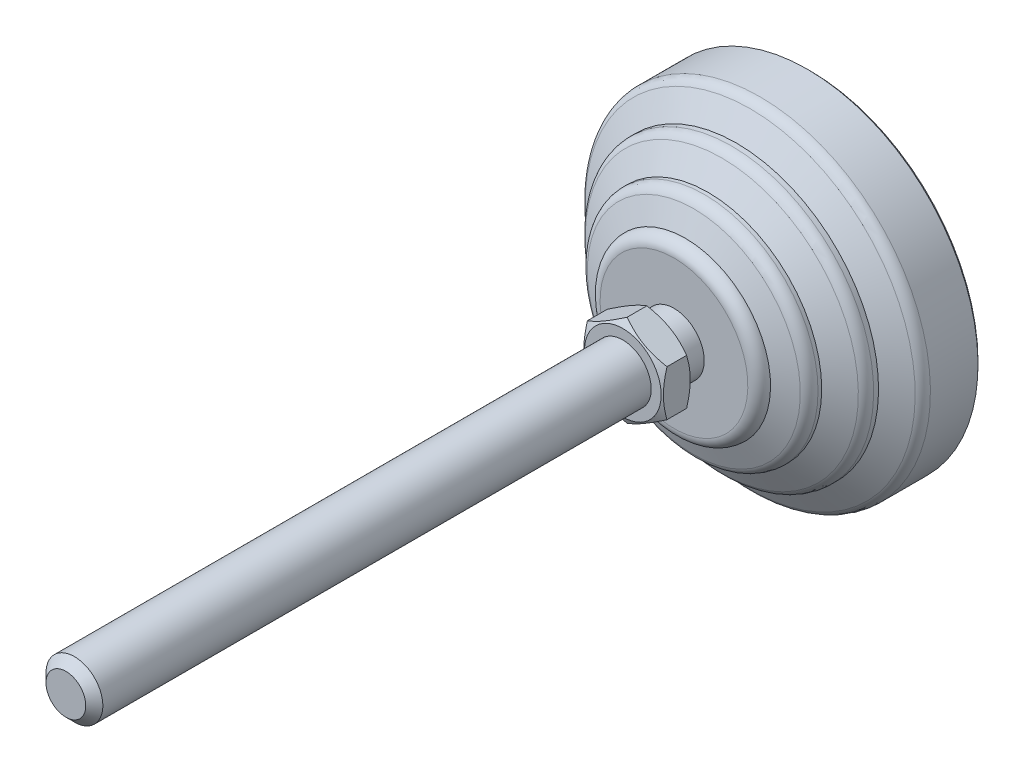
ISO-10303-21;
HEADER;
FILE_DESCRIPTION(('STEP AP214'),'2;1');
FILE_NAME('part.step','',(''),(''),'','','');
FILE_SCHEMA(('AUTOMOTIVE_DESIGN { 1 0 10303 214 1 1 1 1 }'));
ENDSEC;
DATA;
#1=APPLICATION_CONTEXT('core data for automotive mechanical design processes');
#2=APPLICATION_PROTOCOL_DEFINITION('international standard','automotive_design',2000,#1);
#3=PRODUCT_CONTEXT('',#1,'mechanical');
#4=PRODUCT('Part','Part','',(#3));
#5=PRODUCT_RELATED_PRODUCT_CATEGORY('part','',(#4));
#6=PRODUCT_DEFINITION_FORMATION('','',#4);
#7=PRODUCT_DEFINITION_CONTEXT('part definition',#1,'design');
#8=PRODUCT_DEFINITION('design','',#6,#7);
#9=PRODUCT_DEFINITION_SHAPE('','',#8);
#10=(LENGTH_UNIT() NAMED_UNIT(*) SI_UNIT(.MILLI.,.METRE.));
#11=(NAMED_UNIT(*) PLANE_ANGLE_UNIT() SI_UNIT($,.RADIAN.));
#12=(NAMED_UNIT(*) SI_UNIT($,.STERADIAN.) SOLID_ANGLE_UNIT());
#13=UNCERTAINTY_MEASURE_WITH_UNIT(LENGTH_MEASURE(1.E-05),#10,'distance_accuracy_value','');
#14=(GEOMETRIC_REPRESENTATION_CONTEXT(3) GLOBAL_UNCERTAINTY_ASSIGNED_CONTEXT((#13)) GLOBAL_UNIT_ASSIGNED_CONTEXT((#10,
#11,#12)) REPRESENTATION_CONTEXT('',''));
#15=CARTESIAN_POINT('',(0.,0.,0.));
#16=DIRECTION('',(0.,0.,1.));
#17=DIRECTION('',(1.,0.,0.));
#18=AXIS2_PLACEMENT_3D('',#15,#16,#17);
#19=CARTESIAN_POINT('',(-29.5,0.,0.));
#20=DIRECTION('',(0.,0.,1.));
#21=DIRECTION('',(0.,-1.,0.));
#22=AXIS2_PLACEMENT_3D('',#19,#20,#21);
#23=PLANE('',#22);
#24=CARTESIAN_POINT('',(0.,0.,0.));
#25=DIRECTION('',(0.,0.,-1.));
#26=DIRECTION('',(0.,1.,0.));
#27=AXIS2_PLACEMENT_3D('',#24,#25,#26);
#28=CIRCLE('',#27,29.5);
#29=CARTESIAN_POINT('',(0.,29.5,0.));
#30=VERTEX_POINT('',#29);
#31=EDGE_CURVE('E95',#30,#30,#28,.T.);
#32=ORIENTED_EDGE('',*,*,#31,.T.);
#33=EDGE_LOOP('',(#32));
#34=FACE_BOUND('',#33,.T.);
#35=ADVANCED_FACE('F14',(#34),#23,.F.);
#36=CARTESIAN_POINT('',(-5.32445501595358,0.,28.));
#37=DIRECTION('',(0.,0.,1.));
#38=DIRECTION('',(0.,-1.,0.));
#39=AXIS2_PLACEMENT_3D('',#36,#37,#38);
#40=PLANE('',#39);
#41=CARTESIAN_POINT('',(0.,0.,28.));
#42=DIRECTION('',(0.,0.,1.));
#43=DIRECTION('',(1.,0.,0.));
#44=AXIS2_PLACEMENT_3D('',#41,#42,#43);
#45=CIRCLE('',#44,6.75);
#46=CARTESIAN_POINT('',(6.75,0.,28.));
#47=VERTEX_POINT('',#46);
#48=EDGE_CURVE('E542',#47,#47,#45,.T.);
#49=ORIENTED_EDGE('',*,*,#48,.F.);
#50=EDGE_LOOP('',(#49));
#51=FACE_BOUND('',#50,.T.);
#52=CARTESIAN_POINT('',(0.,0.,28.));
#53=DIRECTION('',(0.,0.,-1.));
#54=DIRECTION('',(0.,1.,0.));
#55=AXIS2_PLACEMENT_3D('',#52,#53,#54);
#56=CIRCLE('',#55,5.32445501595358);
#57=CARTESIAN_POINT('',(0.,5.32445501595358,28.));
#58=VERTEX_POINT('',#57);
#59=EDGE_CURVE('E74',#58,#58,#56,.T.);
#60=ORIENTED_EDGE('',*,*,#59,.F.);
#61=EDGE_LOOP('',(#60));
#62=FACE_BOUND('',#61,.T.);
#63=ADVANCED_FACE('F270',(#51,#62),#40,.F.);
#64=CARTESIAN_POINT('',(0.,0.,0.));
#65=DIRECTION('',(0.,0.,-1.));
#66=DIRECTION('',(0.,1.,0.));
#67=AXIS2_PLACEMENT_3D('',#64,#65,#66);
#68=CYLINDRICAL_SURFACE('',#67,5.32445501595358);
#69=CARTESIAN_POINT('',(0.,0.,24.));
#70=DIRECTION('',(0.,0.,-1.));
#71=DIRECTION('',(0.,1.,0.));
#72=AXIS2_PLACEMENT_3D('',#69,#70,#71);
#73=CIRCLE('',#72,5.32445501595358);
#74=CARTESIAN_POINT('',(0.,5.32445501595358,24.));
#75=VERTEX_POINT('',#74);
#76=EDGE_CURVE('E131',#75,#75,#73,.T.);
#77=ORIENTED_EDGE('',*,*,#76,.F.);
#78=EDGE_LOOP('',(#77));
#79=FACE_BOUND('',#78,.T.);
#80=ORIENTED_EDGE('',*,*,#59,.T.);
#81=EDGE_LOOP('',(#80));
#82=FACE_BOUND('',#81,.T.);
#83=ADVANCED_FACE('F266',(#79,#82),#68,.T.);
#84=CARTESIAN_POINT('',(-13.,0.,24.));
#85=DIRECTION('',(0.,0.,-1.));
#86=DIRECTION('',(0.,1.,0.));
#87=AXIS2_PLACEMENT_3D('',#84,#85,#86);
#88=PLANE('',#87);
#89=CARTESIAN_POINT('',(0.,0.,24.));
#90=DIRECTION('',(0.,0.,-1.));
#91=DIRECTION('',(0.,1.,0.));
#92=AXIS2_PLACEMENT_3D('',#89,#90,#91);
#93=CIRCLE('',#92,13.);
#94=CARTESIAN_POINT('',(0.,13.,24.));
#95=VERTEX_POINT('',#94);
#96=EDGE_CURVE('E128',#95,#95,#93,.T.);
#97=ORIENTED_EDGE('',*,*,#96,.F.);
#98=EDGE_LOOP('',(#97));
#99=FACE_BOUND('',#98,.T.);
#100=ORIENTED_EDGE('',*,*,#76,.T.);
#101=EDGE_LOOP('',(#100));
#102=FACE_BOUND('',#101,.T.);
#103=ADVANCED_FACE('F262',(#99,#102),#88,.F.);
#104=CARTESIAN_POINT('',(0.,0.,22.));
#105=DIRECTION('',(0.,0.,-1.));
#106=DIRECTION('',(0.,1.,0.));
#107=AXIS2_PLACEMENT_3D('',#104,#105,#106);
#108=TOROIDAL_SURFACE('',#107,13.,2.);
#109=CARTESIAN_POINT('',(0.,0.,22.));
#110=DIRECTION('',(0.,0.,-1.));
#111=DIRECTION('',(0.,1.,0.));
#112=AXIS2_PLACEMENT_3D('',#109,#110,#111);
#113=CIRCLE('',#112,15.);
#114=CARTESIAN_POINT('',(0.,15.,22.));
#115=VERTEX_POINT('',#114);
#116=EDGE_CURVE('E125',#115,#115,#113,.T.);
#117=ORIENTED_EDGE('',*,*,#116,.F.);
#118=EDGE_LOOP('',(#117));
#119=FACE_BOUND('',#118,.T.);
#120=ORIENTED_EDGE('',*,*,#96,.T.);
#121=EDGE_LOOP('',(#120));
#122=FACE_BOUND('',#121,.T.);
#123=ADVANCED_FACE('F258',(#119,#122),#108,.T.);
#124=CARTESIAN_POINT('',(0.,0.,22.));
#125=DIRECTION('',(0.,0.,-1.));
#126=DIRECTION('',(0.,1.,0.));
#127=AXIS2_PLACEMENT_3D('',#124,#125,#126);
#128=CONICAL_SURFACE('',#127,15.,1.19028994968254);
#129=CARTESIAN_POINT('',(0.,0.,20.5028874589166));
#130=DIRECTION('',(0.,0.,-1.));
#131=DIRECTION('',(0.,1.,0.));
#132=AXIS2_PLACEMENT_3D('',#129,#130,#131);
#133=CIRCLE('',#132,18.7427813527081);
#134=CARTESIAN_POINT('',(0.,18.7427813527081,20.5028874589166));
#135=VERTEX_POINT('',#134);
#136=EDGE_CURVE('E122',#135,#135,#133,.T.);
#137=ORIENTED_EDGE('',*,*,#136,.F.);
#138=EDGE_LOOP('',(#137));
#139=FACE_BOUND('',#138,.T.);
#140=ORIENTED_EDGE('',*,*,#116,.T.);
#141=EDGE_LOOP('',(#140));
#142=FACE_BOUND('',#141,.T.);
#143=ADVANCED_FACE('F254',(#139,#142),#128,.T.);
#144=CARTESIAN_POINT('',(0.,0.,18.6459340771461));
#145=DIRECTION('',(0.,0.,-1.));
#146=DIRECTION('',(0.,1.,0.));
#147=AXIS2_PLACEMENT_3D('',#144,#145,#146);
#148=TOROIDAL_SURFACE('',#147,18.,2.00000000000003);
#149=CARTESIAN_POINT('',(0.,0.,18.645934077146));
#150=DIRECTION('',(0.,0.,-1.));
#151=DIRECTION('',(0.,1.,0.));
#152=AXIS2_PLACEMENT_3D('',#149,#150,#151);
#153=CIRCLE('',#152,20.);
#154=CARTESIAN_POINT('',(0.,20.,18.645934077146));
#155=VERTEX_POINT('',#154);
#156=EDGE_CURVE('E119',#155,#155,#153,.T.);
#157=ORIENTED_EDGE('',*,*,#156,.F.);
#158=EDGE_LOOP('',(#157));
#159=FACE_BOUND('',#158,.T.);
#160=ORIENTED_EDGE('',*,*,#136,.T.);
#161=EDGE_LOOP('',(#160));
#162=FACE_BOUND('',#161,.T.);
#163=ADVANCED_FACE('F250',(#159,#162),#148,.T.);
#164=CARTESIAN_POINT('',(0.,0.,0.));
#165=DIRECTION('',(0.,0.,-1.));
#166=DIRECTION('',(0.,1.,0.));
#167=AXIS2_PLACEMENT_3D('',#164,#165,#166);
#168=CYLINDRICAL_SURFACE('',#167,20.);
#169=CARTESIAN_POINT('',(0.,0.,18.));
#170=DIRECTION('',(0.,0.,-1.));
#171=DIRECTION('',(0.,1.,0.));
#172=AXIS2_PLACEMENT_3D('',#169,#170,#171);
#173=CIRCLE('',#172,20.);
#174=CARTESIAN_POINT('',(0.,20.,18.));
#175=VERTEX_POINT('',#174);
#176=EDGE_CURVE('E116',#175,#175,#173,.T.);
#177=ORIENTED_EDGE('',*,*,#176,.F.);
#178=EDGE_LOOP('',(#177));
#179=FACE_BOUND('',#178,.T.);
#180=ORIENTED_EDGE('',*,*,#156,.T.);
#181=EDGE_LOOP('',(#180));
#182=FACE_BOUND('',#181,.T.);
#183=ADVANCED_FACE('F246',(#179,#182),#168,.T.);
#184=CARTESIAN_POINT('',(0.,0.,18.));
#185=DIRECTION('',(0.,0.,-1.));
#186=DIRECTION('',(0.,1.,0.));
#187=AXIS2_PLACEMENT_3D('',#184,#185,#186);
#188=CONICAL_SURFACE('',#187,20.,1.03037682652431);
#189=CARTESIAN_POINT('',(0.,0.,15.5826050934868));
#190=DIRECTION('',(0.,0.,-1.));
#191=DIRECTION('',(0.,1.,0.));
#192=AXIS2_PLACEMENT_3D('',#189,#190,#191);
#193=CIRCLE('',#192,24.0289915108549);
#194=CARTESIAN_POINT('',(0.,24.0289915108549,15.5826050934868));
#195=VERTEX_POINT('',#194);
#196=EDGE_CURVE('E113',#195,#195,#193,.T.);
#197=ORIENTED_EDGE('',*,*,#196,.F.);
#198=EDGE_LOOP('',(#197));
#199=FACE_BOUND('',#198,.T.);
#200=ORIENTED_EDGE('',*,*,#176,.T.);
#201=EDGE_LOOP('',(#200));
#202=FACE_BOUND('',#201,.T.);
#203=ADVANCED_FACE('F242',(#199,#202),#188,.T.);
#204=CARTESIAN_POINT('',(0.,0.,13.8676192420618));
#205=DIRECTION('',(0.,0.,-1.));
#206=DIRECTION('',(0.,1.,0.));
#207=AXIS2_PLACEMENT_3D('',#204,#205,#206);
#208=TOROIDAL_SURFACE('',#207,23.,2.00000000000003);
#209=CARTESIAN_POINT('',(0.,0.,13.8676192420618));
#210=DIRECTION('',(0.,0.,-1.));
#211=DIRECTION('',(0.,1.,0.));
#212=AXIS2_PLACEMENT_3D('',#209,#210,#211);
#213=CIRCLE('',#212,25.);
#214=CARTESIAN_POINT('',(0.,25.,13.8676192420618));
#215=VERTEX_POINT('',#214);
#216=EDGE_CURVE('E110',#215,#215,#213,.T.);
#217=ORIENTED_EDGE('',*,*,#216,.F.);
#218=EDGE_LOOP('',(#217));
#219=FACE_BOUND('',#218,.T.);
#220=ORIENTED_EDGE('',*,*,#196,.T.);
#221=EDGE_LOOP('',(#220));
#222=FACE_BOUND('',#221,.T.);
#223=ADVANCED_FACE('F238',(#219,#222),#208,.T.);
#224=CARTESIAN_POINT('',(0.,0.,0.));
#225=DIRECTION('',(0.,0.,-1.));
#226=DIRECTION('',(0.,1.,0.));
#227=AXIS2_PLACEMENT_3D('',#224,#225,#226);
#228=CYLINDRICAL_SURFACE('',#227,25.);
#229=CARTESIAN_POINT('',(0.,0.,13.));
#230=DIRECTION('',(0.,0.,-1.));
#231=DIRECTION('',(0.,1.,0.));
#232=AXIS2_PLACEMENT_3D('',#229,#230,#231);
#233=CIRCLE('',#232,25.);
#234=CARTESIAN_POINT('',(0.,25.,13.));
#235=VERTEX_POINT('',#234);
#236=EDGE_CURVE('E107',#235,#235,#233,.T.);
#237=ORIENTED_EDGE('',*,*,#236,.F.);
#238=EDGE_LOOP('',(#237));
#239=FACE_BOUND('',#238,.T.);
#240=ORIENTED_EDGE('',*,*,#216,.T.);
#241=EDGE_LOOP('',(#240));
#242=FACE_BOUND('',#241,.T.);
#243=ADVANCED_FACE('F234',(#239,#242),#228,.T.);
#244=CARTESIAN_POINT('',(0.,0.,13.));
#245=DIRECTION('',(0.,0.,-1.));
#246=DIRECTION('',(0.,1.,0.));
#247=AXIS2_PLACEMENT_3D('',#244,#245,#246);
#248=CONICAL_SURFACE('',#247,25.,1.03037682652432);
#249=CARTESIAN_POINT('',(0.,0.,10.5826050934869));
#250=DIRECTION('',(0.,0.,-1.));
#251=DIRECTION('',(0.,1.,0.));
#252=AXIS2_PLACEMENT_3D('',#249,#250,#251);
#253=CIRCLE('',#252,29.028991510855);
#254=CARTESIAN_POINT('',(0.,29.028991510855,10.5826050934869));
#255=VERTEX_POINT('',#254);
#256=EDGE_CURVE('E104',#255,#255,#253,.T.);
#257=ORIENTED_EDGE('',*,*,#256,.F.);
#258=EDGE_LOOP('',(#257));
#259=FACE_BOUND('',#258,.T.);
#260=ORIENTED_EDGE('',*,*,#236,.T.);
#261=EDGE_LOOP('',(#260));
#262=FACE_BOUND('',#261,.T.);
#263=ADVANCED_FACE('F230',(#259,#262),#248,.T.);
#264=CARTESIAN_POINT('',(0.,0.,8.86761924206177));
#265=DIRECTION('',(0.,0.,-1.));
#266=DIRECTION('',(0.,1.,0.));
#267=AXIS2_PLACEMENT_3D('',#264,#265,#266);
#268=TOROIDAL_SURFACE('',#267,28.,2.00000000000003);
#269=CARTESIAN_POINT('',(0.,0.,8.86761924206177));
#270=DIRECTION('',(0.,0.,-1.));
#271=DIRECTION('',(0.,1.,0.));
#272=AXIS2_PLACEMENT_3D('',#269,#270,#271);
#273=CIRCLE('',#272,30.);
#274=CARTESIAN_POINT('',(0.,30.,8.86761924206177));
#275=VERTEX_POINT('',#274);
#276=EDGE_CURVE('E101',#275,#275,#273,.T.);
#277=ORIENTED_EDGE('',*,*,#276,.F.);
#278=EDGE_LOOP('',(#277));
#279=FACE_BOUND('',#278,.T.);
#280=ORIENTED_EDGE('',*,*,#256,.T.);
#281=EDGE_LOOP('',(#280));
#282=FACE_BOUND('',#281,.T.);
#283=ADVANCED_FACE('F226',(#279,#282),#268,.T.);
#284=CARTESIAN_POINT('',(0.,0.,0.));
#285=DIRECTION('',(0.,0.,-1.));
#286=DIRECTION('',(0.,1.,0.));
#287=AXIS2_PLACEMENT_3D('',#284,#285,#286);
#288=CYLINDRICAL_SURFACE('',#287,30.);
#289=CARTESIAN_POINT('',(0.,0.,0.499999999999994));
#290=DIRECTION('',(0.,0.,-1.));
#291=DIRECTION('',(0.,1.,0.));
#292=AXIS2_PLACEMENT_3D('',#289,#290,#291);
#293=CIRCLE('',#292,30.);
#294=CARTESIAN_POINT('',(0.,30.,0.499999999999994));
#295=VERTEX_POINT('',#294);
#296=EDGE_CURVE('E98',#295,#295,#293,.T.);
#297=ORIENTED_EDGE('',*,*,#296,.F.);
#298=EDGE_LOOP('',(#297));
#299=FACE_BOUND('',#298,.T.);
#300=ORIENTED_EDGE('',*,*,#276,.T.);
#301=EDGE_LOOP('',(#300));
#302=FACE_BOUND('',#301,.T.);
#303=ADVANCED_FACE('F222',(#299,#302),#288,.T.);
#304=CARTESIAN_POINT('',(0.,0.,0.499999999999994));
#305=DIRECTION('',(0.,0.,1.));
#306=DIRECTION('',(0.,-1.,0.));
#307=AXIS2_PLACEMENT_3D('',#304,#305,#306);
#308=CONICAL_SURFACE('',#307,30.,0.785398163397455);
#309=ORIENTED_EDGE('',*,*,#31,.F.);
#310=EDGE_LOOP('',(#309));
#311=FACE_BOUND('',#310,.T.);
#312=ORIENTED_EDGE('',*,*,#296,.T.);
#313=EDGE_LOOP('',(#312));
#314=FACE_BOUND('',#313,.T.);
#315=ADVANCED_FACE('F150',(#311,#314),#308,.T.);
#316=CARTESIAN_POINT('',(0.,0.,28.));
#317=DIRECTION('',(0.,0.,1.));
#318=DIRECTION('',(1.,0.,0.));
#319=AXIS2_PLACEMENT_3D('',#316,#317,#318);
#320=CONICAL_SURFACE('',#319,6.75,1.0471975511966);
#321=CARTESIAN_POINT('',(0.000200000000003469,-8.0830192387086,28.7696190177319));
#322=CARTESIAN_POINT('',(-0.153667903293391,-7.99418356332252,28.7183374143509));
#323=CARTESIAN_POINT('',(-0.30810950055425,-7.90501666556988,28.669383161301));
#324=CARTESIAN_POINT('',(-0.618246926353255,-7.72595873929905,28.5767703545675));
#325=CARTESIAN_POINT('',(-0.773943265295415,-7.63606741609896,28.5331140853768));
#326=CARTESIAN_POINT('',(-1.24352516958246,-7.36495417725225,28.4109491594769));
#327=CARTESIAN_POINT('',(-1.5592643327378,-7.18266208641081,28.3414631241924));
#328=CARTESIAN_POINT('',(-2.03176224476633,-6.90986528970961,28.2599825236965));
#329=CARTESIAN_POINT('',(-2.18710922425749,-6.82017566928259,28.2367710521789));
#330=CARTESIAN_POINT('',(-2.49850511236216,-6.64039116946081,28.1978487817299));
#331=CARTESIAN_POINT('',(-2.65455395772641,-6.55029632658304,28.1821373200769));
#332=CARTESIAN_POINT('',(-2.96692267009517,-6.36995016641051,28.1586154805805));
#333=CARTESIAN_POINT('',(-3.12324202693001,-6.27969914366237,28.1507961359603));
#334=CARTESIAN_POINT('',(-3.43601650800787,-6.09911871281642,28.1432178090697));
#335=CARTESIAN_POINT('',(-3.59247162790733,-6.00878930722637,28.1434585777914));
#336=CARTESIAN_POINT('',(-4.02110687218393,-5.76131663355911,28.155197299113));
#337=CARTESIAN_POINT('',(-4.2931466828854,-5.60425437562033,28.1749033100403));
#338=CARTESIAN_POINT('',(-4.83541944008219,-5.29117305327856,28.2373910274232));
#339=CARTESIAN_POINT('',(-5.10565047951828,-5.13515508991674,28.2801940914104));
#340=CARTESIAN_POINT('',(-5.64901454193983,-4.82144370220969,28.3871892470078));
#341=CARTESIAN_POINT('',(-5.92207900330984,-4.6637898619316,28.4518346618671));
#342=CARTESIAN_POINT('',(-6.46413578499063,-4.35083323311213,28.5985536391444));
#343=CARTESIAN_POINT('',(-6.73313504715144,-4.19552643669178,28.680592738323));
#344=CARTESIAN_POINT('',(-7.0002,-4.04133641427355,28.7696190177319));
#345=B_SPLINE_CURVE_WITH_KNOTS('',3,(#321,#322,#323,#324,#325,#326,#327,#328,#329,#330,#331,
#332,#333,#334,#335,#336,#337,#338,#339,#340,#341,#342,#343,#344),.UNSPECIFIED.,.F.,.F.,(4,2,2,
2,2,2,2,2,2,2,2,4),(0.,0.554727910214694,1.10969417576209,2.2219327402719,2.76443041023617,
3.30688013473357,3.8487128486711,4.39052882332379,5.33376515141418,6.27787517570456,
7.24292418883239,8.20607866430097),.UNSPECIFIED.);
#346=CARTESIAN_POINT('',(0.,-8.08290376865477,28.7695523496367));
#347=VERTEX_POINT('',#346);
#348=CARTESIAN_POINT('',(-7.,-4.04145188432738,28.7695523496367));
#349=VERTEX_POINT('',#348);
#350=EDGE_CURVE('E69',#347,#349,#345,.T.);
#351=ORIENTED_EDGE('',*,*,#350,.T.);
#352=CARTESIAN_POINT('',(-7.,-10.8452199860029,31.5553751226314));
#353=CARTESIAN_POINT('',(-7.,-10.5395720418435,31.4071511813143));
#354=CARTESIAN_POINT('',(-7.,-10.2332213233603,31.2603515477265));
#355=CARTESIAN_POINT('',(-7.,-9.61874054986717,30.9704021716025));
#356=CARTESIAN_POINT('',(-7.,-9.31061022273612,30.8272530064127));
#357=CARTESIAN_POINT('',(-7.,-8.69060378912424,30.544683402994));
#358=CARTESIAN_POINT('',(-7.,-8.378716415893,30.4052876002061));
#359=CARTESIAN_POINT('',(-7.,-7.75245735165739,30.1322147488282));
#360=CARTESIAN_POINT('',(-7.,-7.43808577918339,29.998537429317));
#361=CARTESIAN_POINT('',(-7.,-6.79625322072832,29.7342508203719));
#362=CARTESIAN_POINT('',(-7.,-6.46869506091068,29.6038762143));
#363=CARTESIAN_POINT('',(-7.,-5.8097434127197,29.3530199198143));
#364=CARTESIAN_POINT('',(-7.,-5.47834949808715,29.2325393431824));
#365=CARTESIAN_POINT('',(-7.,-4.81181879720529,29.0046420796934));
#366=CARTESIAN_POINT('',(-7.,-4.47669118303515,28.8971988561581));
#367=CARTESIAN_POINT('',(-7.,-3.80164083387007,28.6988295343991));
#368=CARTESIAN_POINT('',(-7.,-3.46171964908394,28.6078982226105));
#369=CARTESIAN_POINT('',(-7.,-2.77871657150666,28.4474124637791));
#370=CARTESIAN_POINT('',(-7.,-2.43566256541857,28.377742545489));
#371=CARTESIAN_POINT('',(-7.,-1.91796608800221,28.2922053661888));
#372=CARTESIAN_POINT('',(-7.,-1.74486856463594,28.2668530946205));
#373=CARTESIAN_POINT('',(-7.,-1.39781674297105,28.2229686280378));
#374=CARTESIAN_POINT('',(-7.,-1.22386252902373,28.2044357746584));
#375=CARTESIAN_POINT('',(-7.,-0.877598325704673,28.1747912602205));
#376=CARTESIAN_POINT('',(-7.,-0.705296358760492,28.1635862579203));
#377=CARTESIAN_POINT('',(-7.,-0.360373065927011,28.1484717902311));
#378=CARTESIAN_POINT('',(-7.,-0.187751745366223,28.1445622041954));
#379=CARTESIAN_POINT('',(-7.,0.157501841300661,28.144131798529));
#380=CARTESIAN_POINT('',(-7.,0.330134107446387,28.1476110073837));
#381=CARTESIAN_POINT('',(-7.,0.675098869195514,28.1618733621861));
#382=CARTESIAN_POINT('',(-7.,0.847431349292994,28.1726568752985));
#383=CARTESIAN_POINT('',(-7.,1.26191843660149,28.2071493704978));
#384=CARTESIAN_POINT('',(-7.,1.50378924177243,28.2343417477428));
#385=CARTESIAN_POINT('',(-7.,1.98571736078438,28.3016288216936));
#386=CARTESIAN_POINT('',(-7.,2.2257744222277,28.3417252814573));
#387=CARTESIAN_POINT('',(-7.,2.94296071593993,28.4792430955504));
#388=CARTESIAN_POINT('',(-7.,3.41683397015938,28.5938673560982));
#389=CARTESIAN_POINT('',(-7.,4.12538961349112,28.7924093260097));
#390=CARTESIAN_POINT('',(-7.,4.36375290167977,28.8639442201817));
#391=CARTESIAN_POINT('',(-7.,4.83816391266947,29.0143875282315));
#392=CARTESIAN_POINT('',(-7.,5.07421162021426,29.0932959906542));
#393=CARTESIAN_POINT('',(-7.,5.54406683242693,29.2572250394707));
#394=CARTESIAN_POINT('',(-7.,5.77787505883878,29.34224357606));
#395=CARTESIAN_POINT('',(-7.,6.24355808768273,29.5173980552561));
#396=CARTESIAN_POINT('',(-7.,6.47543291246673,29.6075339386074));
#397=CARTESIAN_POINT('',(-7.,7.02148459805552,29.8256304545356));
#398=CARTESIAN_POINT('',(-7.,7.33492707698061,29.9554263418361));
#399=CARTESIAN_POINT('',(-7.,7.95915802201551,30.2212686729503));
#400=CARTESIAN_POINT('',(-7.,8.26994632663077,30.3573154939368));
#401=CARTESIAN_POINT('',(-7.,8.8893557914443,30.6344071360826));
#402=CARTESIAN_POINT('',(-7.,9.19797650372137,30.7754529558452));
#403=CARTESIAN_POINT('',(-7.,9.81336169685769,31.0615445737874));
#404=CARTESIAN_POINT('',(-7.,10.1201261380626,31.2065904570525));
#405=CARTESIAN_POINT('',(-7.,10.7324212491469,31.5000858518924));
#406=CARTESIAN_POINT('',(-7.,11.0379502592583,31.6485388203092));
#407=CARTESIAN_POINT('',(-7.,11.6476939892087,31.9481222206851));
#408=CARTESIAN_POINT('',(-7.,11.9519086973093,32.0992526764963));
#409=CARTESIAN_POINT('',(-7.,12.8628143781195,32.555909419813));
#410=CARTESIAN_POINT('',(-7.,13.4678484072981,32.8647404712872));
#411=CARTESIAN_POINT('',(-7.,14.6242379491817,33.4625166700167));
#412=CARTESIAN_POINT('',(-7.,15.1758513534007,33.7509651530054));
#413=CARTESIAN_POINT('',(-7.,16.2770286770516,34.3317917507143));
#414=CARTESIAN_POINT('',(-7.,16.8265925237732,34.6241700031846));
#415=CARTESIAN_POINT('',(-7.,17.9227595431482,35.211191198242));
#416=CARTESIAN_POINT('',(-7.,18.4693666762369,35.5058267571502));
#417=CARTESIAN_POINT('',(-7.,19.5612700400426,36.0974468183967));
#418=CARTESIAN_POINT('',(-7.,20.1065663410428,36.3944311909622));
#419=CARTESIAN_POINT('',(-7.,20.6513799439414,36.6922925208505));
#420=B_SPLINE_CURVE_WITH_KNOTS('',3,(#352,#353,#354,#355,#356,#357,#358,#359,#360,#361,#362,
#363,#364,#365,#366,#367,#368,#369,#370,#371,#372,#373,#374,#375,#376,#377,#378,#379,#380,#381,
#382,#383,#384,#385,#386,#387,#388,#389,#390,#391,#392,#393,#394,#395,#396,#397,#398,#399,#400,
#401,#402,#403,#404,#405,#406,#407,#408,#409,#410,#411,#412,#413,#414,#415,#416,#417,#418,#419),
.UNSPECIFIED.,.F.,.F.,(4,2,2,2,2,2,2,2,2,2,2,2,2,2,2,2,2,2,2,2,2,2,2,2,2,2,2,2,2,2,2,2,2,4),(0.,
1.0190900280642,2.03834024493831,3.0631573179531,4.08792578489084,5.14545340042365,
6.20309968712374,7.2585557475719,8.31367797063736,9.36296340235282,9.88768295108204,
10.4123518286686,10.930200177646,11.4480399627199,11.9658817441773,12.4837495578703,
13.213520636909,13.9433914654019,15.4039463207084,16.1504827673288,16.8970241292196,
17.643316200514,18.3895996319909,19.4072697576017,20.4250013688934,21.4429374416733,
22.4608951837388,23.4799358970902,24.4989856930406,26.5368137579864,28.4042333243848,
30.2717185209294,32.1345879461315,33.9973551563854),.UNSPECIFIED.);
#421=CARTESIAN_POINT('',(-7.,4.04145188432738,28.7695523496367));
#422=VERTEX_POINT('',#421);
#423=EDGE_CURVE('E80',#349,#422,#420,.T.);
#424=ORIENTED_EDGE('',*,*,#423,.T.);
#425=CARTESIAN_POINT('',(-7.0002,4.04133641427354,28.7696190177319));
#426=CARTESIAN_POINT('',(-6.84633209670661,4.13017208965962,28.7183374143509));
#427=CARTESIAN_POINT('',(-6.69189049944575,4.21933898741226,28.669383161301));
#428=CARTESIAN_POINT('',(-6.38175307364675,4.39839691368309,28.5767703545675));
#429=CARTESIAN_POINT('',(-6.22605673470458,4.48828823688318,28.5331140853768));
#430=CARTESIAN_POINT('',(-5.75647483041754,4.75940147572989,28.4109491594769));
#431=CARTESIAN_POINT('',(-5.4407356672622,4.94169356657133,28.3414631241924));
#432=CARTESIAN_POINT('',(-4.96823775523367,5.21449036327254,28.2599825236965));
#433=CARTESIAN_POINT('',(-4.81289077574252,5.30417998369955,28.2367710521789));
#434=CARTESIAN_POINT('',(-4.50149488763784,5.48396448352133,28.1978487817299));
#435=CARTESIAN_POINT('',(-4.34544604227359,5.57405932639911,28.1821373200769));
#436=CARTESIAN_POINT('',(-4.03307732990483,5.75440548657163,28.1586154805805));
#437=CARTESIAN_POINT('',(-3.87675797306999,5.84465650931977,28.1507961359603));
#438=CARTESIAN_POINT('',(-3.56398349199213,6.02523694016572,28.1432178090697));
#439=CARTESIAN_POINT('',(-3.40752837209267,6.11556634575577,28.1434585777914));
#440=CARTESIAN_POINT('',(-2.97889312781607,6.36303901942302,28.155197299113));
#441=CARTESIAN_POINT('',(-2.7068533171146,6.52010127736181,28.1749033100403));
#442=CARTESIAN_POINT('',(-2.16458055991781,6.83318259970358,28.2373910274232));
#443=CARTESIAN_POINT('',(-1.89434952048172,6.9892005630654,28.2801940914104));
#444=CARTESIAN_POINT('',(-1.35098545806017,7.30291195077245,28.3871892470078));
#445=CARTESIAN_POINT('',(-1.07792099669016,7.46056579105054,28.4518346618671));
#446=CARTESIAN_POINT('',(-0.535864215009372,7.77352241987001,28.5985536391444));
#447=CARTESIAN_POINT('',(-0.266864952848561,7.92882921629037,28.680592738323));
#448=CARTESIAN_POINT('',(0.000199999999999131,8.0830192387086,28.7696190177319));
#449=B_SPLINE_CURVE_WITH_KNOTS('',3,(#425,#426,#427,#428,#429,#430,#431,#432,#433,#434,#435,
#436,#437,#438,#439,#440,#441,#442,#443,#444,#445,#446,#447,#448),.UNSPECIFIED.,.F.,.F.,(4,2,2,
2,2,2,2,2,2,2,2,4),(0.,0.554727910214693,1.10969417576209,2.2219327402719,2.76443041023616,
3.30688013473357,3.84871284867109,4.39052882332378,5.33376515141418,6.27787517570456,
7.2429241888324,8.20607866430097),.UNSPECIFIED.);
#450=CARTESIAN_POINT('',(0.,8.08290376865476,28.7695523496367));
#451=VERTEX_POINT('',#450);
#452=EDGE_CURVE('E174',#422,#451,#449,.T.);
#453=ORIENTED_EDGE('',*,*,#452,.T.);
#454=CARTESIAN_POINT('',(-0.000200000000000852,8.0830192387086,28.7696190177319));
#455=CARTESIAN_POINT('',(0.15366790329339,7.99418356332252,28.7183374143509));
#456=CARTESIAN_POINT('',(0.308109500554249,7.90501666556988,28.669383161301));
#457=CARTESIAN_POINT('',(0.618246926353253,7.72595873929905,28.5767703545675));
#458=CARTESIAN_POINT('',(0.773943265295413,7.63606741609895,28.5331140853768));
#459=CARTESIAN_POINT('',(1.24352516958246,7.36495417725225,28.4109491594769));
#460=CARTESIAN_POINT('',(1.5592643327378,7.18266208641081,28.3414631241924));
#461=CARTESIAN_POINT('',(2.03176224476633,6.9098652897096,28.2599825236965));
#462=CARTESIAN_POINT('',(2.18710922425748,6.82017566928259,28.2367710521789));
#463=CARTESIAN_POINT('',(2.49850511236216,6.64039116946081,28.1978487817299));
#464=CARTESIAN_POINT('',(2.65455395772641,6.55029632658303,28.1821373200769));
#465=CARTESIAN_POINT('',(2.96692267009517,6.36995016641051,28.1586154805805));
#466=CARTESIAN_POINT('',(3.12324202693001,6.27969914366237,28.1507961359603));
#467=CARTESIAN_POINT('',(3.43601650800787,6.09911871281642,28.1432178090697));
#468=CARTESIAN_POINT('',(3.59247162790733,6.00878930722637,28.1434585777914));
#469=CARTESIAN_POINT('',(4.02110687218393,5.76131663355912,28.155197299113));
#470=CARTESIAN_POINT('',(4.2931466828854,5.60425437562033,28.1749033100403));
#471=CARTESIAN_POINT('',(4.83541944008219,5.29117305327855,28.2373910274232));
#472=CARTESIAN_POINT('',(5.10565047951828,5.13515508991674,28.2801940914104));
#473=CARTESIAN_POINT('',(5.64901454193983,4.82144370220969,28.3871892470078));
#474=CARTESIAN_POINT('',(5.92207900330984,4.66378986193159,28.4518346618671));
#475=CARTESIAN_POINT('',(6.46413578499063,4.35083323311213,28.5985536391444));
#476=CARTESIAN_POINT('',(6.73313504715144,4.19552643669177,28.680592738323));
#477=CARTESIAN_POINT('',(7.0002,4.04133641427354,28.7696190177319));
#478=B_SPLINE_CURVE_WITH_KNOTS('',3,(#454,#455,#456,#457,#458,#459,#460,#461,#462,#463,#464,
#465,#466,#467,#468,#469,#470,#471,#472,#473,#474,#475,#476,#477),.UNSPECIFIED.,.F.,.F.,(4,2,2,
2,2,2,2,2,2,2,2,4),(0.,0.554727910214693,1.10969417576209,2.2219327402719,2.76443041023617,
3.30688013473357,3.8487128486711,4.39052882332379,5.33376515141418,6.27787517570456,
7.2429241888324,8.20607866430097),.UNSPECIFIED.);
#479=CARTESIAN_POINT('',(7.,4.04145188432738,28.7695523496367));
#480=VERTEX_POINT('',#479);
#481=EDGE_CURVE('E167',#451,#480,#478,.T.);
#482=ORIENTED_EDGE('',*,*,#481,.T.);
#483=CARTESIAN_POINT('',(7.,-10.8452199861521,31.5553751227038));
#484=CARTESIAN_POINT('',(7.,-10.5395720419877,31.4071511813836));
#485=CARTESIAN_POINT('',(7.,-10.2332213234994,31.2603515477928));
#486=CARTESIAN_POINT('',(7.,-9.61874054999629,30.9704021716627));
#487=CARTESIAN_POINT('',(7.,-9.31061022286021,30.82725300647));
#488=CARTESIAN_POINT('',(7.,-8.69060378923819,30.5446834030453));
#489=CARTESIAN_POINT('',(7.,-8.37871641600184,30.4052876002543));
#490=CARTESIAN_POINT('',(7.,-7.75245735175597,30.1322147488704));
#491=CARTESIAN_POINT('',(7.,-7.43808577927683,29.9985374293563));
#492=CARTESIAN_POINT('',(7.,-6.79625322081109,29.7342508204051));
#493=CARTESIAN_POINT('',(7.,-6.46869506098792,29.6038762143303));
#494=CARTESIAN_POINT('',(7.,-5.8097434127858,29.3530199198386));
#495=CARTESIAN_POINT('',(7.,-5.47834949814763,29.2325393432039));
#496=CARTESIAN_POINT('',(7.,-4.81181879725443,29.0046420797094));
#497=CARTESIAN_POINT('',(7.,-4.47669118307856,28.8971988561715));
#498=CARTESIAN_POINT('',(7.,-3.80164083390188,28.6988295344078));
#499=CARTESIAN_POINT('',(7.,-3.46171964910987,28.607898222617));
#500=CARTESIAN_POINT('',(7.,-2.77871657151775,28.4474124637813));
#501=CARTESIAN_POINT('',(7.,-2.43566256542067,28.3777425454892));
#502=CARTESIAN_POINT('',(7.,-1.91796608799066,28.292205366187));
#503=CARTESIAN_POINT('',(7.,-1.74486856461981,28.2668530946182));
#504=CARTESIAN_POINT('',(7.,-1.39781674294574,28.2229686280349));
#505=CARTESIAN_POINT('',(7.,-1.2238625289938,28.2044357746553));
#506=CARTESIAN_POINT('',(7.,-0.877598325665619,28.1747912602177));
#507=CARTESIAN_POINT('',(7.,-0.705296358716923,28.1635862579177));
#508=CARTESIAN_POINT('',(7.,-0.360373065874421,28.1484717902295));
#509=CARTESIAN_POINT('',(7.,-0.187751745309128,28.1445622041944));
#510=CARTESIAN_POINT('',(7.,0.15750184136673,28.1441317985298));
#511=CARTESIAN_POINT('',(7.,0.330134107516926,28.1476110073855));
#512=CARTESIAN_POINT('',(7.,0.675098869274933,28.1618733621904));
#513=CARTESIAN_POINT('',(7.,0.847431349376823,28.1726568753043));
#514=CARTESIAN_POINT('',(7.,1.26191843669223,28.2071493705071));
#515=CARTESIAN_POINT('',(7.,1.50378924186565,28.234341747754));
#516=CARTESIAN_POINT('',(7.,1.98571736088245,28.301628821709));
#517=CARTESIAN_POINT('',(7.,2.22577442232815,28.3417252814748));
#518=CARTESIAN_POINT('',(7.,2.94296071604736,28.4792430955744));
#519=CARTESIAN_POINT('',(7.,3.41683397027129,28.5938673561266));
#520=CARTESIAN_POINT('',(7.,4.12538961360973,28.7924093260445));
#521=CARTESIAN_POINT('',(7.,4.36375290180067,28.8639442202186));
#522=CARTESIAN_POINT('',(7.,4.83816391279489,29.0143875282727));
#523=CARTESIAN_POINT('',(7.,5.07421162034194,29.0932959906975));
#524=CARTESIAN_POINT('',(7.,5.5440668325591,29.2572250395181));
#525=CARTESIAN_POINT('',(7.,5.77787505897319,29.3422435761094));
#526=CARTESIAN_POINT('',(7.,6.24355808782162,29.5173980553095));
#527=CARTESIAN_POINT('',(7.,6.47543291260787,29.6075339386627));
#528=CARTESIAN_POINT('',(7.,7.02148459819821,29.825630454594));
#529=CARTESIAN_POINT('',(7.,7.33492707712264,29.9554263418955));
#530=CARTESIAN_POINT('',(7.,7.95915802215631,30.2212686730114));
#531=CARTESIAN_POINT('',(7.,8.269946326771,30.3573154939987));
#532=CARTESIAN_POINT('',(7.,8.88935579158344,30.6344071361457));
#533=CARTESIAN_POINT('',(7.,9.19797650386,30.7754529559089));
#534=CARTESIAN_POINT('',(7.,9.81336169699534,31.0615445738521));
#535=CARTESIAN_POINT('',(7.,10.1201261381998,31.2065904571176));
#536=CARTESIAN_POINT('',(7.,10.7324212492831,31.5000858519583));
#537=CARTESIAN_POINT('',(7.,11.0379502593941,31.6485388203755));
#538=CARTESIAN_POINT('',(7.,11.6476939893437,31.9481222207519));
#539=CARTESIAN_POINT('',(7.,11.9519086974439,32.0992526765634));
#540=CARTESIAN_POINT('',(7.,12.862814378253,32.5559094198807));
#541=CARTESIAN_POINT('',(7.,13.4678484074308,32.8647404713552));
#542=CARTESIAN_POINT('',(7.,14.6242379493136,33.4625166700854));
#543=CARTESIAN_POINT('',(7.,15.1758513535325,33.7509651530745));
#544=CARTESIAN_POINT('',(7.,16.2770286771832,34.3317917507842));
#545=CARTESIAN_POINT('',(7.,16.8265925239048,34.6241700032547));
#546=CARTESIAN_POINT('',(7.,17.9227595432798,35.2111911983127));
#547=CARTESIAN_POINT('',(7.,18.4693666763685,35.5058267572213));
#548=CARTESIAN_POINT('',(7.,19.5612700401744,36.0974468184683));
#549=CARTESIAN_POINT('',(7.,20.1065663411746,36.3944311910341));
#550=CARTESIAN_POINT('',(7.,20.6513799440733,36.6922925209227));
#551=B_SPLINE_CURVE_WITH_KNOTS('',3,(#483,#484,#485,#486,#487,#488,#489,#490,#491,#492,#493,
#494,#495,#496,#497,#498,#499,#500,#501,#502,#503,#504,#505,#506,#507,#508,#509,#510,#511,#512,
#513,#514,#515,#516,#517,#518,#519,#520,#521,#522,#523,#524,#525,#526,#527,#528,#529,#530,#531,
#532,#533,#534,#535,#536,#537,#538,#539,#540,#541,#542,#543,#544,#545,#546,#547,#548,#549,#550),
.UNSPECIFIED.,.F.,.F.,(4,2,2,2,2,2,2,2,2,2,2,2,2,2,2,2,2,2,2,2,2,2,2,2,2,2,2,2,2,2,2,2,2,4),(0.,
1.01909002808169,2.0383402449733,3.06315731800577,4.0879257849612,5.14545340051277,
6.20309968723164,7.25855574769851,8.31367797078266,9.36296340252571,9.88768295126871,
10.4123518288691,10.9302001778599,11.4480399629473,11.9658817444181,12.4837495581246,
13.2135206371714,13.9433914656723,15.403946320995,16.1504827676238,16.8970241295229,
17.6433162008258,18.389599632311,19.4072697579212,20.4250013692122,21.4429374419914,
22.4608951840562,23.4799358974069,24.4989856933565,26.5368137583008,28.4042333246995,
30.2717185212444,32.134587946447,33.9973551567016),.UNSPECIFIED.);
#552=CARTESIAN_POINT('',(7.,-4.04145188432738,28.7695523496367));
#553=VERTEX_POINT('',#552);
#554=EDGE_CURVE('E29',#480,#553,#551,.F.);
#555=ORIENTED_EDGE('',*,*,#554,.T.);
#556=CARTESIAN_POINT('',(7.0002,-4.04133641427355,28.7696190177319));
#557=CARTESIAN_POINT('',(6.84633209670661,-4.13017208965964,28.7183374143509));
#558=CARTESIAN_POINT('',(6.69189049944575,-4.21933898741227,28.669383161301));
#559=CARTESIAN_POINT('',(6.38175307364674,-4.3983969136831,28.5767703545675));
#560=CARTESIAN_POINT('',(6.22605673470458,-4.4882882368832,28.5331140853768));
#561=CARTESIAN_POINT('',(5.75647483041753,-4.7594014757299,28.4109491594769));
#562=CARTESIAN_POINT('',(5.4407356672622,-4.94169356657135,28.3414631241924));
#563=CARTESIAN_POINT('',(4.96823775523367,-5.21449036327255,28.2599825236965));
#564=CARTESIAN_POINT('',(4.81289077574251,-5.30417998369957,28.2367710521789));
#565=CARTESIAN_POINT('',(4.50149488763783,-5.48396448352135,28.1978487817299));
#566=CARTESIAN_POINT('',(4.34544604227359,-5.57405932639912,28.1821373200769));
#567=CARTESIAN_POINT('',(4.03307732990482,-5.75440548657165,28.1586154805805));
#568=CARTESIAN_POINT('',(3.87675797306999,-5.84465650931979,28.1507961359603));
#569=CARTESIAN_POINT('',(3.56398349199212,-6.02523694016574,28.1432178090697));
#570=CARTESIAN_POINT('',(3.40752837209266,-6.11556634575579,28.1434585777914));
#571=CARTESIAN_POINT('',(2.97889312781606,-6.36303901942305,28.155197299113));
#572=CARTESIAN_POINT('',(2.7068533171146,-6.52010127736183,28.1749033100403));
#573=CARTESIAN_POINT('',(2.1645805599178,-6.8331825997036,28.2373910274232));
#574=CARTESIAN_POINT('',(1.89434952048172,-6.98920056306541,28.2801940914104));
#575=CARTESIAN_POINT('',(1.35098545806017,-7.30291195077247,28.3871892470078));
#576=CARTESIAN_POINT('',(1.07792099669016,-7.46056579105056,28.4518346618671));
#577=CARTESIAN_POINT('',(0.535864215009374,-7.77352241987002,28.5985536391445));
#578=CARTESIAN_POINT('',(0.266864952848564,-7.92882921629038,28.680592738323));
#579=CARTESIAN_POINT('',(-0.000199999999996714,-8.08301923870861,28.7696190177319));
#580=B_SPLINE_CURVE_WITH_KNOTS('',3,(#556,#557,#558,#559,#560,#561,#562,#563,#564,#565,#566,
#567,#568,#569,#570,#571,#572,#573,#574,#575,#576,#577,#578,#579),.UNSPECIFIED.,.F.,.F.,(4,2,2,
2,2,2,2,2,2,2,2,4),(0.,0.554727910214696,1.10969417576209,2.2219327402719,2.76443041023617,
3.30688013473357,3.8487128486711,4.39052882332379,5.33376515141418,6.27787517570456,
7.24292418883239,8.20607866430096),.UNSPECIFIED.);
#581=EDGE_CURVE('E66',#553,#347,#580,.T.);
#582=ORIENTED_EDGE('',*,*,#581,.T.);
#583=EDGE_LOOP('',(#351,#424,#453,#482,#555,#582));
#584=FACE_BOUND('',#583,.T.);
#585=ORIENTED_EDGE('',*,*,#48,.T.);
#586=EDGE_LOOP('',(#585));
#587=FACE_BOUND('',#586,.T.);
#588=ADVANCED_FACE('F67',(#584,#587),#320,.T.);
#589=CARTESIAN_POINT('',(-4.82445501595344,0.,33.));
#590=DIRECTION('',(0.,0.,-1.));
#591=DIRECTION('',(0.,1.,0.));
#592=AXIS2_PLACEMENT_3D('',#589,#590,#591);
#593=PLANE('',#592);
#594=CARTESIAN_POINT('',(0.,0.,33.));
#595=DIRECTION('',(0.,0.,-1.));
#596=DIRECTION('',(-1.,0.,0.));
#597=AXIS2_PLACEMENT_3D('',#594,#595,#596);
#598=CIRCLE('',#597,5.);
#599=CARTESIAN_POINT('',(-5.,0.,33.));
#600=VERTEX_POINT('',#599);
#601=EDGE_CURVE('E73',#600,#600,#598,.F.);
#602=ORIENTED_EDGE('',*,*,#601,.F.);
#603=EDGE_LOOP('',(#602));
#604=FACE_BOUND('',#603,.T.);
#605=CARTESIAN_POINT('',(0.,0.,33.));
#606=DIRECTION('',(0.,0.,1.));
#607=DIRECTION('',(1.,0.,0.));
#608=AXIS2_PLACEMENT_3D('',#605,#606,#607);
#609=CIRCLE('',#608,6.75);
#610=CARTESIAN_POINT('',(6.75,0.,33.));
#611=VERTEX_POINT('',#610);
#612=EDGE_CURVE('E79',#611,#611,#609,.T.);
#613=ORIENTED_EDGE('',*,*,#612,.T.);
#614=EDGE_LOOP('',(#613));
#615=FACE_BOUND('',#614,.T.);
#616=ADVANCED_FACE('F149',(#604,#615),#593,.F.);
#617=CARTESIAN_POINT('',(0.,0.,31.1763989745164));
#618=DIRECTION('',(0.,0.,-1.));
#619=DIRECTION('',(-1.,0.,0.));
#620=AXIS2_PLACEMENT_3D('',#617,#618,#619);
#621=CONICAL_SURFACE('',#620,9.90856962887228,1.0471975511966);
#622=CARTESIAN_POINT('',(-7.0002,-4.04133641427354,32.2303809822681));
#623=CARTESIAN_POINT('',(-6.84633209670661,-4.13017208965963,32.2816625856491));
#624=CARTESIAN_POINT('',(-6.69189049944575,-4.21933898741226,32.330616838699));
#625=CARTESIAN_POINT('',(-6.38175307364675,-4.39839691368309,32.4232296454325));
#626=CARTESIAN_POINT('',(-6.22605673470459,-4.48828823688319,32.4668859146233));
#627=CARTESIAN_POINT('',(-5.75647483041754,-4.75940147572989,32.5890508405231));
#628=CARTESIAN_POINT('',(-5.4407356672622,-4.94169356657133,32.6585368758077));
#629=CARTESIAN_POINT('',(-4.96823775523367,-5.21449036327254,32.7400174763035));
#630=CARTESIAN_POINT('',(-4.81289077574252,-5.30417998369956,32.7632289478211));
#631=CARTESIAN_POINT('',(-4.50149488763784,-5.48396448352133,32.8021512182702));
#632=CARTESIAN_POINT('',(-4.3454460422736,-5.57405932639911,32.8178626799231));
#633=CARTESIAN_POINT('',(-4.03307732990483,-5.75440548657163,32.8413845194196));
#634=CARTESIAN_POINT('',(-3.87675797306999,-5.84465650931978,32.8492038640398));
#635=CARTESIAN_POINT('',(-3.56398349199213,-6.02523694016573,32.8567821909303));
#636=CARTESIAN_POINT('',(-3.40752837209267,-6.11556634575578,32.8565414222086));
#637=CARTESIAN_POINT('',(-2.97889312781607,-6.36303901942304,32.844802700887));
#638=CARTESIAN_POINT('',(-2.7068533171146,-6.52010127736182,32.8250966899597));
#639=CARTESIAN_POINT('',(-2.1645805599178,-6.83318259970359,32.7626089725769));
#640=CARTESIAN_POINT('',(-1.89434952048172,-6.98920056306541,32.7198059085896));
#641=CARTESIAN_POINT('',(-1.35098545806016,-7.30291195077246,32.6128107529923));
#642=CARTESIAN_POINT('',(-1.07792099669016,-7.46056579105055,32.5481653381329));
#643=CARTESIAN_POINT('',(-0.535864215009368,-7.77352241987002,32.4014463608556));
#644=CARTESIAN_POINT('',(-0.266864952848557,-7.92882921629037,32.319407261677));
#645=CARTESIAN_POINT('',(0.000200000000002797,-8.0830192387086,32.2303809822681));
#646=B_SPLINE_CURVE_WITH_KNOTS('',3,(#622,#623,#624,#625,#626,#627,#628,#629,#630,#631,#632,
#633,#634,#635,#636,#637,#638,#639,#640,#641,#642,#643,#644,#645),.UNSPECIFIED.,.F.,.F.,(4,2,2,
2,2,2,2,2,2,2,2,4),(0.,0.554727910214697,1.10969417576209,2.2219327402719,2.76443041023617,
3.30688013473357,3.8487128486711,4.39052882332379,5.33376515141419,6.27787517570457,
7.24292418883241,8.20607866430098),.UNSPECIFIED.);
#647=CARTESIAN_POINT('',(-7.,-4.04145188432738,32.2304476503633));
#648=VERTEX_POINT('',#647);
#649=CARTESIAN_POINT('',(0.,-8.08290376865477,32.2304476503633));
#650=VERTEX_POINT('',#649);
#651=EDGE_CURVE('E87',#648,#650,#646,.T.);
#652=ORIENTED_EDGE('',*,*,#651,.T.);
#653=CARTESIAN_POINT('',(-0.00019999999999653,-8.08301923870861,32.2303809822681));
#654=CARTESIAN_POINT('',(0.153667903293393,-7.99418356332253,32.2816625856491));
#655=CARTESIAN_POINT('',(0.308109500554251,-7.90501666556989,32.330616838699));
#656=CARTESIAN_POINT('',(0.618246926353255,-7.72595873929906,32.4232296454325));
#657=CARTESIAN_POINT('',(0.773943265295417,-7.63606741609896,32.4668859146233));
#658=CARTESIAN_POINT('',(1.24352516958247,-7.36495417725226,32.5890508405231));
#659=CARTESIAN_POINT('',(1.5592643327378,-7.18266208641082,32.6585368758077));
#660=CARTESIAN_POINT('',(2.03176224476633,-6.90986528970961,32.7400174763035));
#661=CARTESIAN_POINT('',(2.18710922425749,-6.8201756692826,32.7632289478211));
#662=CARTESIAN_POINT('',(2.49850511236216,-6.64039116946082,32.8021512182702));
#663=CARTESIAN_POINT('',(2.65455395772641,-6.55029632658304,32.8178626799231));
#664=CARTESIAN_POINT('',(2.96692267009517,-6.36995016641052,32.8413845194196));
#665=CARTESIAN_POINT('',(3.12324202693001,-6.27969914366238,32.8492038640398));
#666=CARTESIAN_POINT('',(3.43601650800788,-6.09911871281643,32.8567821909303));
#667=CARTESIAN_POINT('',(3.59247162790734,-6.00878930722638,32.8565414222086));
#668=CARTESIAN_POINT('',(4.02110687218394,-5.76131663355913,32.844802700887));
#669=CARTESIAN_POINT('',(4.2931466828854,-5.60425437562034,32.8250966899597));
#670=CARTESIAN_POINT('',(4.8354194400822,-5.29117305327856,32.7626089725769));
#671=CARTESIAN_POINT('',(5.10565047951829,-5.13515508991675,32.7198059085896));
#672=CARTESIAN_POINT('',(5.64901454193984,-4.8214437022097,32.6128107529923));
#673=CARTESIAN_POINT('',(5.92207900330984,-4.6637898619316,32.5481653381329));
#674=CARTESIAN_POINT('',(6.46413578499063,-4.35083323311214,32.4014463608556));
#675=CARTESIAN_POINT('',(6.73313504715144,-4.19552643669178,32.3194072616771));
#676=CARTESIAN_POINT('',(7.0002,-4.04133641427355,32.2303809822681));
#677=B_SPLINE_CURVE_WITH_KNOTS('',3,(#653,#654,#655,#656,#657,#658,#659,#660,#661,#662,#663,
#664,#665,#666,#667,#668,#669,#670,#671,#672,#673,#674,#675,#676),.UNSPECIFIED.,.F.,.F.,(4,2,2,
2,2,2,2,2,2,2,2,4),(0.,0.554727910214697,1.10969417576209,2.2219327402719,2.76443041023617,
3.30688013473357,3.8487128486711,4.39052882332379,5.33376515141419,6.27787517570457,
7.2429241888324,8.20607866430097),.UNSPECIFIED.);
#678=CARTESIAN_POINT('',(7.,-4.04145188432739,32.2304476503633));
#679=VERTEX_POINT('',#678);
#680=EDGE_CURVE('E85',#650,#679,#677,.T.);
#681=ORIENTED_EDGE('',*,*,#680,.T.);
#682=CARTESIAN_POINT('',(7.,-10.8452199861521,29.4446248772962));
#683=CARTESIAN_POINT('',(7.,-10.5395720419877,29.5928488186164));
#684=CARTESIAN_POINT('',(7.,-10.2332213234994,29.7396484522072));
#685=CARTESIAN_POINT('',(7.,-9.6187405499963,30.0295978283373));
#686=CARTESIAN_POINT('',(7.,-9.31061022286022,30.17274699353));
#687=CARTESIAN_POINT('',(7.,-8.69060378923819,30.4553165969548));
#688=CARTESIAN_POINT('',(7.,-8.37871641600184,30.5947123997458));
#689=CARTESIAN_POINT('',(7.,-7.75245735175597,30.8677852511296));
#690=CARTESIAN_POINT('',(7.,-7.43808577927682,31.0014625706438));
#691=CARTESIAN_POINT('',(7.,-6.79625322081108,31.2657491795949));
#692=CARTESIAN_POINT('',(7.,-6.46869506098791,31.3961237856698));
#693=CARTESIAN_POINT('',(7.,-5.80974341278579,31.6469800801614));
#694=CARTESIAN_POINT('',(7.,-5.47834949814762,31.7674606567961));
#695=CARTESIAN_POINT('',(7.,-4.81181879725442,31.9953579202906));
#696=CARTESIAN_POINT('',(7.,-4.47669118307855,32.1028011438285));
#697=CARTESIAN_POINT('',(7.,-3.80164083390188,32.3011704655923));
#698=CARTESIAN_POINT('',(7.,-3.46171964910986,32.3921017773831));
#699=CARTESIAN_POINT('',(7.,-2.77871657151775,32.5525875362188));
#700=CARTESIAN_POINT('',(7.,-2.43566256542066,32.6222574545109));
#701=CARTESIAN_POINT('',(7.,-1.91796608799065,32.7077946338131));
#702=CARTESIAN_POINT('',(7.,-1.7448685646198,32.7331469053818));
#703=CARTESIAN_POINT('',(7.,-1.39781674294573,32.7770313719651));
#704=CARTESIAN_POINT('',(7.,-1.2238625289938,32.7955642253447));
#705=CARTESIAN_POINT('',(7.,-0.877598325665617,32.8252087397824));
#706=CARTESIAN_POINT('',(7.,-0.70529635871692,32.8364137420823));
#707=CARTESIAN_POINT('',(7.,-0.360373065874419,32.8515282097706));
#708=CARTESIAN_POINT('',(7.,-0.187751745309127,32.8554377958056));
#709=CARTESIAN_POINT('',(7.,0.15750184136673,32.8558682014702));
#710=CARTESIAN_POINT('',(7.,0.330134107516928,32.8523889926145));
#711=CARTESIAN_POINT('',(7.,0.675098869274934,32.8381266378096));
#712=CARTESIAN_POINT('',(7.,0.847431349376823,32.8273431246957));
#713=CARTESIAN_POINT('',(7.,1.26191843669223,32.7928506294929));
#714=CARTESIAN_POINT('',(7.,1.50378924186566,32.765658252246));
#715=CARTESIAN_POINT('',(7.,1.98571736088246,32.698371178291));
#716=CARTESIAN_POINT('',(7.,2.22577442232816,32.6582747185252));
#717=CARTESIAN_POINT('',(7.,2.94296071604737,32.5207569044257));
#718=CARTESIAN_POINT('',(7.,3.4168339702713,32.4061326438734));
#719=CARTESIAN_POINT('',(7.,4.12538961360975,32.2075906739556));
#720=CARTESIAN_POINT('',(7.,4.36375290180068,32.1360557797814));
#721=CARTESIAN_POINT('',(7.,4.8381639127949,31.9856124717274));
#722=CARTESIAN_POINT('',(7.,5.07421162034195,31.9067040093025));
#723=CARTESIAN_POINT('',(7.,5.54406683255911,31.742774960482));
#724=CARTESIAN_POINT('',(7.,5.7778750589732,31.6577564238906));
#725=CARTESIAN_POINT('',(7.,6.24355808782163,31.4826019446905));
#726=CARTESIAN_POINT('',(7.,6.47543291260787,31.3924660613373));
#727=CARTESIAN_POINT('',(7.,7.02148459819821,31.174369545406));
#728=CARTESIAN_POINT('',(7.,7.33492707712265,31.0445736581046));
#729=CARTESIAN_POINT('',(7.,7.95915802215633,30.7787313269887));
#730=CARTESIAN_POINT('',(7.,8.26994632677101,30.6426845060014));
#731=CARTESIAN_POINT('',(7.,8.88935579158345,30.3655928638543));
#732=CARTESIAN_POINT('',(7.,9.19797650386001,30.2245470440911));
#733=CARTESIAN_POINT('',(7.,9.81336169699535,29.9384554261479));
#734=CARTESIAN_POINT('',(7.,10.1201261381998,29.7934095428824));
#735=CARTESIAN_POINT('',(7.,10.7324212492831,29.4999141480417));
#736=CARTESIAN_POINT('',(7.,11.0379502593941,29.3514611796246));
#737=CARTESIAN_POINT('',(7.,11.6476939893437,29.0518777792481));
#738=CARTESIAN_POINT('',(7.,11.9519086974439,28.9007473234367));
#739=CARTESIAN_POINT('',(7.,12.862814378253,28.4440905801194));
#740=CARTESIAN_POINT('',(7.,13.4678484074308,28.1352595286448));
#741=CARTESIAN_POINT('',(7.,14.6242379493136,27.5374833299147));
#742=CARTESIAN_POINT('',(7.,15.1758513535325,27.2490348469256));
#743=CARTESIAN_POINT('',(7.,16.2770286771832,26.6682082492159));
#744=CARTESIAN_POINT('',(7.,16.8265925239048,26.3758299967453));
#745=CARTESIAN_POINT('',(7.,17.9227595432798,25.7888088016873));
#746=CARTESIAN_POINT('',(7.,18.4693666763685,25.4941732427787));
#747=CARTESIAN_POINT('',(7.,19.5612700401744,24.9025531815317));
#748=CARTESIAN_POINT('',(7.,20.1065663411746,24.6055688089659));
#749=CARTESIAN_POINT('',(7.,20.6513799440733,24.3077074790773));
#750=B_SPLINE_CURVE_WITH_KNOTS('',3,(#682,#683,#684,#685,#686,#687,#688,#689,#690,#691,#692,
#693,#694,#695,#696,#697,#698,#699,#700,#701,#702,#703,#704,#705,#706,#707,#708,#709,#710,#711,
#712,#713,#714,#715,#716,#717,#718,#719,#720,#721,#722,#723,#724,#725,#726,#727,#728,#729,#730,
#731,#732,#733,#734,#735,#736,#737,#738,#739,#740,#741,#742,#743,#744,#745,#746,#747,#748,#749),
.UNSPECIFIED.,.F.,.F.,(4,2,2,2,2,2,2,2,2,2,2,2,2,2,2,2,2,2,2,2,2,2,2,2,2,2,2,2,2,2,2,2,2,4),(0.,
1.0190900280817,2.03834024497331,3.06315731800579,4.08792578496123,5.1454534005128,
6.20309968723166,7.25855574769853,8.31367797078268,9.36296340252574,9.88768295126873,
10.4123518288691,10.9302001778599,11.4480399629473,11.9658817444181,12.4837495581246,
13.2135206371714,13.9433914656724,15.403946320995,16.1504827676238,16.897024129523,
17.6433162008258,18.3895996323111,19.4072697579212,20.4250013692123,21.4429374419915,
22.4608951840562,23.4799358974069,24.4989856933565,26.5368137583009,28.4042333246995,
30.2717185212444,32.1345879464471,33.9973551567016),.UNSPECIFIED.);
#751=CARTESIAN_POINT('',(7.,4.04145188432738,32.2304476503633));
#752=VERTEX_POINT('',#751);
#753=EDGE_CURVE('E507',#679,#752,#750,.T.);
#754=ORIENTED_EDGE('',*,*,#753,.T.);
#755=CARTESIAN_POINT('',(7.0002,4.04133641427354,32.2303809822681));
#756=CARTESIAN_POINT('',(6.84633209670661,4.13017208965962,32.2816625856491));
#757=CARTESIAN_POINT('',(6.69189049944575,4.21933898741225,32.330616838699));
#758=CARTESIAN_POINT('',(6.38175307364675,4.39839691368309,32.4232296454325));
#759=CARTESIAN_POINT('',(6.22605673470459,4.48828823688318,32.4668859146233));
#760=CARTESIAN_POINT('',(5.75647483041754,4.75940147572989,32.5890508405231));
#761=CARTESIAN_POINT('',(5.4407356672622,4.94169356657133,32.6585368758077));
#762=CARTESIAN_POINT('',(4.96823775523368,5.21449036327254,32.7400174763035));
#763=CARTESIAN_POINT('',(4.81289077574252,5.30417998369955,32.7632289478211));
#764=CARTESIAN_POINT('',(4.50149488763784,5.48396448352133,32.8021512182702));
#765=CARTESIAN_POINT('',(4.3454460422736,5.5740593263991,32.8178626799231));
#766=CARTESIAN_POINT('',(4.03307732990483,5.75440548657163,32.8413845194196));
#767=CARTESIAN_POINT('',(3.87675797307,5.84465650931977,32.8492038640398));
#768=CARTESIAN_POINT('',(3.56398349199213,6.02523694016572,32.8567821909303));
#769=CARTESIAN_POINT('',(3.40752837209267,6.11556634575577,32.8565414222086));
#770=CARTESIAN_POINT('',(2.97889312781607,6.36303901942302,32.844802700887));
#771=CARTESIAN_POINT('',(2.7068533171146,6.52010127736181,32.8250966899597));
#772=CARTESIAN_POINT('',(2.1645805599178,6.83318259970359,32.7626089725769));
#773=CARTESIAN_POINT('',(1.89434952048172,6.9892005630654,32.7198059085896));
#774=CARTESIAN_POINT('',(1.35098545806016,7.30291195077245,32.6128107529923));
#775=CARTESIAN_POINT('',(1.07792099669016,7.46056579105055,32.548165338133));
#776=CARTESIAN_POINT('',(0.535864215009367,7.77352241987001,32.4014463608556));
#777=CARTESIAN_POINT('',(0.266864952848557,7.92882921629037,32.3194072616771));
#778=CARTESIAN_POINT('',(-0.000200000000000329,8.0830192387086,32.2303809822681));
#779=B_SPLINE_CURVE_WITH_KNOTS('',3,(#755,#756,#757,#758,#759,#760,#761,#762,#763,#764,#765,
#766,#767,#768,#769,#770,#771,#772,#773,#774,#775,#776,#777,#778),.UNSPECIFIED.,.F.,.F.,(4,2,2,
2,2,2,2,2,2,2,2,4),(0.,0.554727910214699,1.10969417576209,2.2219327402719,2.76443041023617,
3.30688013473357,3.8487128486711,4.39052882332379,5.33376515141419,6.27787517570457,
7.24292418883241,8.20607866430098),.UNSPECIFIED.);
#780=CARTESIAN_POINT('',(0.,8.08290376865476,32.2304476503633));
#781=VERTEX_POINT('',#780);
#782=EDGE_CURVE('E519',#752,#781,#779,.T.);
#783=ORIENTED_EDGE('',*,*,#782,.T.);
#784=CARTESIAN_POINT('',(0.000199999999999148,8.0830192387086,32.2303809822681));
#785=CARTESIAN_POINT('',(-0.15366790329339,7.99418356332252,32.2816625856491));
#786=CARTESIAN_POINT('',(-0.308109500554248,7.90501666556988,32.330616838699));
#787=CARTESIAN_POINT('',(-0.618246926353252,7.72595873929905,32.4232296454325));
#788=CARTESIAN_POINT('',(-0.773943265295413,7.63606741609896,32.4668859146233));
#789=CARTESIAN_POINT('',(-1.24352516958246,7.36495417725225,32.5890508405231));
#790=CARTESIAN_POINT('',(-1.5592643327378,7.18266208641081,32.6585368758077));
#791=CARTESIAN_POINT('',(-2.03176224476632,6.9098652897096,32.7400174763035));
#792=CARTESIAN_POINT('',(-2.18710922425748,6.82017566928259,32.7632289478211));
#793=CARTESIAN_POINT('',(-2.49850511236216,6.64039116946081,32.8021512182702));
#794=CARTESIAN_POINT('',(-2.6545539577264,6.55029632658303,32.8178626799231));
#795=CARTESIAN_POINT('',(-2.96692267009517,6.36995016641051,32.8413845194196));
#796=CARTESIAN_POINT('',(-3.12324202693,6.27969914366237,32.8492038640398));
#797=CARTESIAN_POINT('',(-3.43601650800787,6.09911871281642,32.8567821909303));
#798=CARTESIAN_POINT('',(-3.59247162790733,6.00878930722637,32.8565414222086));
#799=CARTESIAN_POINT('',(-4.02110687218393,5.76131663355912,32.844802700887));
#800=CARTESIAN_POINT('',(-4.2931466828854,5.60425437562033,32.8250966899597));
#801=CARTESIAN_POINT('',(-4.8354194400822,5.29117305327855,32.7626089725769));
#802=CARTESIAN_POINT('',(-5.10565047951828,5.13515508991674,32.7198059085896));
#803=CARTESIAN_POINT('',(-5.64901454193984,4.82144370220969,32.6128107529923));
#804=CARTESIAN_POINT('',(-5.92207900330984,4.66378986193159,32.5481653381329));
#805=CARTESIAN_POINT('',(-6.46413578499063,4.35083323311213,32.4014463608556));
#806=CARTESIAN_POINT('',(-6.73313504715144,4.19552643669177,32.3194072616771));
#807=CARTESIAN_POINT('',(-7.0002,4.04133641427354,32.2303809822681));
#808=B_SPLINE_CURVE_WITH_KNOTS('',3,(#784,#785,#786,#787,#788,#789,#790,#791,#792,#793,#794,
#795,#796,#797,#798,#799,#800,#801,#802,#803,#804,#805,#806,#807),.UNSPECIFIED.,.F.,.F.,(4,2,2,
2,2,2,2,2,2,2,2,4),(0.,0.554727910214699,1.10969417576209,2.2219327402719,2.76443041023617,
3.30688013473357,3.8487128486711,4.39052882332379,5.33376515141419,6.27787517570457,
7.2429241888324,8.20607866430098),.UNSPECIFIED.);
#809=CARTESIAN_POINT('',(-7.,4.04145188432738,32.2304476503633));
#810=VERTEX_POINT('',#809);
#811=EDGE_CURVE('E204',#781,#810,#808,.T.);
#812=ORIENTED_EDGE('',*,*,#811,.T.);
#813=CARTESIAN_POINT('',(-7.,-10.8452199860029,29.4446248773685));
#814=CARTESIAN_POINT('',(-7.,-10.5395720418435,29.5928488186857));
#815=CARTESIAN_POINT('',(-7.,-10.2332213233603,29.7396484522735));
#816=CARTESIAN_POINT('',(-7.,-9.61874054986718,30.0295978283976));
#817=CARTESIAN_POINT('',(-7.,-9.31061022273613,30.1727469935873));
#818=CARTESIAN_POINT('',(-7.,-8.69060378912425,30.455316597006));
#819=CARTESIAN_POINT('',(-7.,-8.378716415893,30.594712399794));
#820=CARTESIAN_POINT('',(-7.,-7.75245735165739,30.8677852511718));
#821=CARTESIAN_POINT('',(-7.,-7.4380857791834,31.001462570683));
#822=CARTESIAN_POINT('',(-7.,-6.79625322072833,31.2657491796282));
#823=CARTESIAN_POINT('',(-7.,-6.46869506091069,31.3961237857));
#824=CARTESIAN_POINT('',(-7.,-5.80974341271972,31.6469800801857));
#825=CARTESIAN_POINT('',(-7.,-5.47834949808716,31.7674606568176));
#826=CARTESIAN_POINT('',(-7.,-4.8118187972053,31.9953579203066));
#827=CARTESIAN_POINT('',(-7.,-4.47669118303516,32.102801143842));
#828=CARTESIAN_POINT('',(-7.,-3.80164083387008,32.3011704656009));
#829=CARTESIAN_POINT('',(-7.,-3.46171964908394,32.3921017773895));
#830=CARTESIAN_POINT('',(-7.,-2.77871657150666,32.5525875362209));
#831=CARTESIAN_POINT('',(-7.,-2.43566256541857,32.622257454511));
#832=CARTESIAN_POINT('',(-7.,-1.91796608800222,32.7077946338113));
#833=CARTESIAN_POINT('',(-7.,-1.74486856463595,32.7331469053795));
#834=CARTESIAN_POINT('',(-7.,-1.39781674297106,32.7770313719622));
#835=CARTESIAN_POINT('',(-7.,-1.22386252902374,32.7955642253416));
#836=CARTESIAN_POINT('',(-7.,-0.877598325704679,32.8252087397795));
#837=CARTESIAN_POINT('',(-7.,-0.705296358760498,32.8364137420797));
#838=CARTESIAN_POINT('',(-7.,-0.360373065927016,32.851528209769));
#839=CARTESIAN_POINT('',(-7.,-0.187751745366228,32.8554377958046));
#840=CARTESIAN_POINT('',(-7.,0.157501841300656,32.855868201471));
#841=CARTESIAN_POINT('',(-7.,0.330134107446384,32.8523889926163));
#842=CARTESIAN_POINT('',(-7.,0.675098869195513,32.838126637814));
#843=CARTESIAN_POINT('',(-7.,0.847431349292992,32.8273431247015));
#844=CARTESIAN_POINT('',(-7.,1.26191843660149,32.7928506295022));
#845=CARTESIAN_POINT('',(-7.,1.50378924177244,32.7656582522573));
#846=CARTESIAN_POINT('',(-7.,1.98571736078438,32.6983711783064));
#847=CARTESIAN_POINT('',(-7.,2.22577442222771,32.6582747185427));
#848=CARTESIAN_POINT('',(-7.,2.94296071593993,32.5207569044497));
#849=CARTESIAN_POINT('',(-7.,3.41683397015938,32.4061326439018));
#850=CARTESIAN_POINT('',(-7.,4.12538961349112,32.2075906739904));
#851=CARTESIAN_POINT('',(-7.,4.36375290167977,32.1360557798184));
#852=CARTESIAN_POINT('',(-7.,4.83816391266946,31.9856124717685));
#853=CARTESIAN_POINT('',(-7.,5.07421162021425,31.9067040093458));
#854=CARTESIAN_POINT('',(-7.,5.54406683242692,31.7427749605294));
#855=CARTESIAN_POINT('',(-7.,5.77787505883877,31.65775642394));
#856=CARTESIAN_POINT('',(-7.,6.24355808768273,31.4826019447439));
#857=CARTESIAN_POINT('',(-7.,6.47543291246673,31.3924660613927));
#858=CARTESIAN_POINT('',(-7.,7.02148459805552,31.1743695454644));
#859=CARTESIAN_POINT('',(-7.,7.3349270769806,31.0445736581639));
#860=CARTESIAN_POINT('',(-7.,7.95915802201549,30.7787313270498));
#861=CARTESIAN_POINT('',(-7.,8.26994632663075,30.6426845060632));
#862=CARTESIAN_POINT('',(-7.,8.88935579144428,30.3655928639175));
#863=CARTESIAN_POINT('',(-7.,9.19797650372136,30.2245470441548));
#864=CARTESIAN_POINT('',(-7.,9.81336169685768,29.9384554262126));
#865=CARTESIAN_POINT('',(-7.,10.1201261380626,29.7934095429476));
#866=CARTESIAN_POINT('',(-7.,10.7324212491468,29.4999141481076));
#867=CARTESIAN_POINT('',(-7.,11.0379502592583,29.3514611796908));
#868=CARTESIAN_POINT('',(-7.,11.6476939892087,29.051877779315));
#869=CARTESIAN_POINT('',(-7.,11.9519086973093,28.9007473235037));
#870=CARTESIAN_POINT('',(-7.,12.8628143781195,28.4440905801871));
#871=CARTESIAN_POINT('',(-7.,13.4678484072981,28.1352595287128));
#872=CARTESIAN_POINT('',(-7.,14.6242379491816,27.5374833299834));
#873=CARTESIAN_POINT('',(-7.,15.1758513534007,27.2490348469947));
#874=CARTESIAN_POINT('',(-7.,16.2770286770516,26.6682082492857));
#875=CARTESIAN_POINT('',(-7.,16.8265925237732,26.3758299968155));
#876=CARTESIAN_POINT('',(-7.,17.9227595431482,25.7888088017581));
#877=CARTESIAN_POINT('',(-7.,18.4693666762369,25.4941732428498));
#878=CARTESIAN_POINT('',(-7.,19.5612700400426,24.9025531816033));
#879=CARTESIAN_POINT('',(-7.,20.1065663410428,24.6055688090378));
#880=CARTESIAN_POINT('',(-7.,20.6513799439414,24.3077074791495));
#881=B_SPLINE_CURVE_WITH_KNOTS('',3,(#813,#814,#815,#816,#817,#818,#819,#820,#821,#822,#823,
#824,#825,#826,#827,#828,#829,#830,#831,#832,#833,#834,#835,#836,#837,#838,#839,#840,#841,#842,
#843,#844,#845,#846,#847,#848,#849,#850,#851,#852,#853,#854,#855,#856,#857,#858,#859,#860,#861,
#862,#863,#864,#865,#866,#867,#868,#869,#870,#871,#872,#873,#874,#875,#876,#877,#878,#879,#880),
.UNSPECIFIED.,.F.,.F.,(4,2,2,2,2,2,2,2,2,2,2,2,2,2,2,2,2,2,2,2,2,2,2,2,2,2,2,2,2,2,2,2,2,4),(0.,
1.01909002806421,2.03834024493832,3.06315731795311,4.08792578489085,5.14545340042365,
6.20309968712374,7.2585557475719,8.31367797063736,9.36296340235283,9.88768295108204,
10.4123518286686,10.930200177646,11.4480399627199,11.9658817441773,12.4837495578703,
13.2135206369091,13.9433914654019,15.4039463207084,16.1504827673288,16.8970241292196,
17.643316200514,18.3895996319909,19.4072697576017,20.4250013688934,21.4429374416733,
22.4608951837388,23.4799358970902,24.4989856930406,26.5368137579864,28.4042333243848,
30.2717185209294,32.1345879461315,33.9973551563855),.UNSPECIFIED.);
#882=EDGE_CURVE('E91',#810,#648,#881,.F.);
#883=ORIENTED_EDGE('',*,*,#882,.T.);
#884=EDGE_LOOP('',(#652,#681,#754,#783,#812,#883));
#885=FACE_BOUND('',#884,.T.);
#886=ORIENTED_EDGE('',*,*,#612,.F.);
#887=EDGE_LOOP('',(#886));
#888=FACE_BOUND('',#887,.T.);
#889=ADVANCED_FACE('F152',(#885,#888),#621,.T.);
#890=CARTESIAN_POINT('',(0.,-8.08290376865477,28.));
#891=DIRECTION('',(0.5,-0.866025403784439,0.));
#892=DIRECTION('',(0.866025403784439,0.5,0.));
#893=AXIS2_PLACEMENT_3D('',#890,#891,#892);
#894=PLANE('',#893);
#895=ORIENTED_EDGE('',*,*,#581,.F.);
#896=DIRECTION('',(0.,0.,1.));
#897=VECTOR('',#896,1.);
#898=CARTESIAN_POINT('',(7.,-4.04145188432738,28.));
#899=LINE('',#898,#897);
#900=EDGE_CURVE('E86',#553,#679,#899,.T.);
#901=ORIENTED_EDGE('',*,*,#900,.T.);
#902=ORIENTED_EDGE('',*,*,#680,.F.);
#903=DIRECTION('',(0.,0.,1.));
#904=VECTOR('',#903,1.);
#905=CARTESIAN_POINT('',(0.,-8.08290376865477,28.));
#906=LINE('',#905,#904);
#907=EDGE_CURVE('E37',#347,#650,#906,.T.);
#908=ORIENTED_EDGE('',*,*,#907,.F.);
#909=EDGE_LOOP('',(#895,#901,#902,#908));
#910=FACE_BOUND('',#909,.T.);
#911=ADVANCED_FACE('F83',(#910),#894,.T.);
#912=CARTESIAN_POINT('',(7.,-4.04145188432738,28.));
#913=DIRECTION('',(1.,0.,0.));
#914=DIRECTION('',(0.,1.,0.));
#915=AXIS2_PLACEMENT_3D('',#912,#913,#914);
#916=PLANE('',#915);
#917=ORIENTED_EDGE('',*,*,#554,.F.);
#918=DIRECTION('',(0.,0.,1.));
#919=VECTOR('',#918,1.);
#920=CARTESIAN_POINT('',(7.,4.04145188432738,28.));
#921=LINE('',#920,#919);
#922=EDGE_CURVE('E89',#480,#752,#921,.T.);
#923=ORIENTED_EDGE('',*,*,#922,.T.);
#924=ORIENTED_EDGE('',*,*,#753,.F.);
#925=ORIENTED_EDGE('',*,*,#900,.F.);
#926=EDGE_LOOP('',(#917,#923,#924,#925));
#927=FACE_BOUND('',#926,.T.);
#928=ADVANCED_FACE('F410',(#927),#916,.T.);
#929=CARTESIAN_POINT('',(7.,4.04145188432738,28.));
#930=DIRECTION('',(0.5,0.866025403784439,0.));
#931=DIRECTION('',(-0.866025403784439,0.5,0.));
#932=AXIS2_PLACEMENT_3D('',#929,#930,#931);
#933=PLANE('',#932);
#934=ORIENTED_EDGE('',*,*,#481,.F.);
#935=DIRECTION('',(0.,0.,1.));
#936=VECTOR('',#935,1.);
#937=CARTESIAN_POINT('',(0.,8.08290376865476,28.));
#938=LINE('',#937,#936);
#939=EDGE_CURVE('E536',#451,#781,#938,.T.);
#940=ORIENTED_EDGE('',*,*,#939,.T.);
#941=ORIENTED_EDGE('',*,*,#782,.F.);
#942=ORIENTED_EDGE('',*,*,#922,.F.);
#943=EDGE_LOOP('',(#934,#940,#941,#942));
#944=FACE_BOUND('',#943,.T.);
#945=ADVANCED_FACE('F417',(#944),#933,.T.);
#946=CARTESIAN_POINT('',(0.,8.08290376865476,28.));
#947=DIRECTION('',(-0.5,0.866025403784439,0.));
#948=DIRECTION('',(-0.866025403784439,-0.5,0.));
#949=AXIS2_PLACEMENT_3D('',#946,#947,#948);
#950=PLANE('',#949);
#951=ORIENTED_EDGE('',*,*,#452,.F.);
#952=DIRECTION('',(0.,0.,1.));
#953=VECTOR('',#952,1.);
#954=CARTESIAN_POINT('',(-7.,4.04145188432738,28.));
#955=LINE('',#954,#953);
#956=EDGE_CURVE('E535',#422,#810,#955,.T.);
#957=ORIENTED_EDGE('',*,*,#956,.T.);
#958=ORIENTED_EDGE('',*,*,#811,.F.);
#959=ORIENTED_EDGE('',*,*,#939,.F.);
#960=EDGE_LOOP('',(#951,#957,#958,#959));
#961=FACE_BOUND('',#960,.T.);
#962=ADVANCED_FACE('F193',(#961),#950,.T.);
#963=CARTESIAN_POINT('',(-7.,4.04145188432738,28.));
#964=DIRECTION('',(-1.,0.,0.));
#965=DIRECTION('',(0.,-1.,0.));
#966=AXIS2_PLACEMENT_3D('',#963,#964,#965);
#967=PLANE('',#966);
#968=ORIENTED_EDGE('',*,*,#423,.F.);
#969=DIRECTION('',(0.,0.,1.));
#970=VECTOR('',#969,1.);
#971=CARTESIAN_POINT('',(-7.,-4.04145188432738,28.));
#972=LINE('',#971,#970);
#973=EDGE_CURVE('E78',#349,#648,#972,.T.);
#974=ORIENTED_EDGE('',*,*,#973,.T.);
#975=ORIENTED_EDGE('',*,*,#882,.F.);
#976=ORIENTED_EDGE('',*,*,#956,.F.);
#977=EDGE_LOOP('',(#968,#974,#975,#976));
#978=FACE_BOUND('',#977,.T.);
#979=ADVANCED_FACE('F190',(#978),#967,.T.);
#980=CARTESIAN_POINT('',(-7.,-4.04145188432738,28.));
#981=DIRECTION('',(-0.5,-0.866025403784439,0.));
#982=DIRECTION('',(0.866025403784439,-0.5,0.));
#983=AXIS2_PLACEMENT_3D('',#980,#981,#982);
#984=PLANE('',#983);
#985=ORIENTED_EDGE('',*,*,#350,.F.);
#986=ORIENTED_EDGE('',*,*,#907,.T.);
#987=ORIENTED_EDGE('',*,*,#651,.F.);
#988=ORIENTED_EDGE('',*,*,#973,.F.);
#989=EDGE_LOOP('',(#985,#986,#987,#988));
#990=FACE_BOUND('',#989,.T.);
#991=ADVANCED_FACE('F77',(#990),#984,.T.);
#992=CARTESIAN_POINT('',(0.,0.,131.));
#993=DIRECTION('',(0.,0.,-1.));
#994=DIRECTION('',(-1.,0.,0.));
#995=AXIS2_PLACEMENT_3D('',#992,#993,#994);
#996=CYLINDRICAL_SURFACE('',#995,5.);
#997=CARTESIAN_POINT('',(0.,0.,129.5));
#998=DIRECTION('',(0.,0.,-1.));
#999=DIRECTION('',(-1.,0.,0.));
#1000=AXIS2_PLACEMENT_3D('',#997,#998,#999);
#1001=CIRCLE('',#1000,5.);
#1002=CARTESIAN_POINT('',(-5.,0.,129.5));
#1003=VERTEX_POINT('',#1002);
#1004=EDGE_CURVE('E9',#1003,#1003,#1001,.T.);
#1005=ORIENTED_EDGE('',*,*,#1004,.T.);
#1006=EDGE_LOOP('',(#1005));
#1007=FACE_BOUND('',#1006,.T.);
#1008=ORIENTED_EDGE('',*,*,#601,.T.);
#1009=EDGE_LOOP('',(#1008));
#1010=FACE_BOUND('',#1009,.T.);
#1011=ADVANCED_FACE('F151',(#1007,#1010),#996,.T.);
#1012=CARTESIAN_POINT('',(-3.32445501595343,0.,131.));
#1013=DIRECTION('',(0.,0.,-1.));
#1014=DIRECTION('',(0.,1.,0.));
#1015=AXIS2_PLACEMENT_3D('',#1012,#1013,#1014);
#1016=PLANE('',#1015);
#1017=CARTESIAN_POINT('',(0.,0.,131.));
#1018=DIRECTION('',(0.,0.,-1.));
#1019=DIRECTION('',(-1.,0.,0.));
#1020=AXIS2_PLACEMENT_3D('',#1017,#1018,#1019);
#1021=CIRCLE('',#1020,3.5);
#1022=CARTESIAN_POINT('',(-3.5,0.,131.));
#1023=VERTEX_POINT('',#1022);
#1024=EDGE_CURVE('E22',#1023,#1023,#1021,.F.);
#1025=ORIENTED_EDGE('',*,*,#1024,.T.);
#1026=EDGE_LOOP('',(#1025));
#1027=FACE_BOUND('',#1026,.T.);
#1028=ADVANCED_FACE('F278',(#1027),#1016,.F.);
#1029=CARTESIAN_POINT('',(0.,0.,131.));
#1030=DIRECTION('',(0.,0.,-1.));
#1031=DIRECTION('',(-1.,0.,0.));
#1032=AXIS2_PLACEMENT_3D('',#1029,#1030,#1031);
#1033=CONICAL_SURFACE('',#1032,3.5,0.785398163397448);
#1034=ORIENTED_EDGE('',*,*,#1004,.F.);
#1035=EDGE_LOOP('',(#1034));
#1036=FACE_BOUND('',#1035,.T.);
#1037=ORIENTED_EDGE('',*,*,#1024,.F.);
#1038=EDGE_LOOP('',(#1037));
#1039=FACE_BOUND('',#1038,.T.);
#1040=ADVANCED_FACE('F16',(#1036,#1039),#1033,.T.);
#1041=CLOSED_SHELL('',(#35,#63,#83,#103,#123,#143,#163,#183,#203,#223,#243,#263,#283,#303,#315,
#588,#616,#889,#911,#928,#945,#962,#979,#991,#1011,#1028,#1040));
#1042=MANIFOLD_SOLID_BREP('B1',#1041);
#1043=ADVANCED_BREP_SHAPE_REPRESENTATION('',(#18,#1042),#14);
#1044=SHAPE_DEFINITION_REPRESENTATION(#9,#1043);
ENDSEC;
END-ISO-10303-21;
